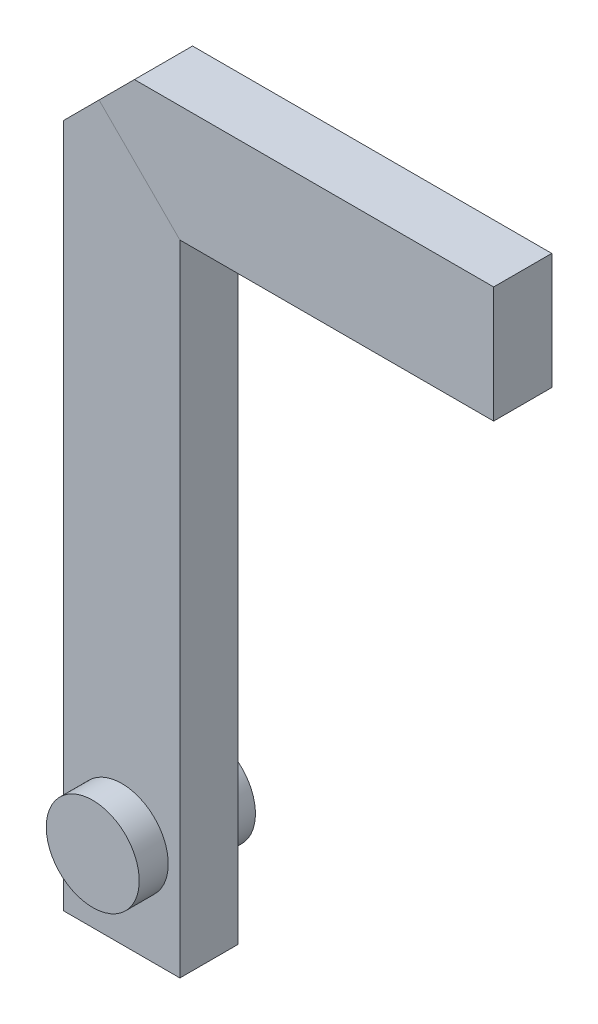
from build123d import *

# Parameters (mm, degrees)
CUT_EXTRUDE1_DEPTH       = 47.115167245
BOSS_EXTRUDE1_DEPTH      = 4.7625
BOSS_EXTRUDE1_DEPTH_BACK = 1.5875
BOSS_EXTRUDE1_START      = -3.175
SKETCH3_R                = 2.54


with BuildPart() as part:
    # Sweep1: sweep along a path in Sketch1
    with BuildLine(Plane.XY) as sweep1_path:
        Line((0, 0), (0, 38.1))
        Line((0, 38.1), (20.32, 38.1))
    # 3DSketch2 → Sweep1 (sweep)
    with BuildSketch(Plane(origin=(20.32, 34.925, -1.5875), x_dir=(0, 0.894427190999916, 0.4472135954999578), z_dir=(-1, 0, 0))):
        Polygon((0, 0), (5.679612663, 2.839806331), (7.099515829, 0), (1.419903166, -2.839806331), align=None)
    sweep(path=sweep1_path.line, transition=Transition.RIGHT)

    # Sketch2 → Cut-Extrude1 (cut, through all)
    with BuildSketch(Plane.XY.offset(1.5875)):
        Polygon((-3.175, 37.409050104), (-1.242025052, 39.342025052), (-3.175, 41.275), align=None)
        Polygon((-3.175, 41.275), (-1.242025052, 39.342025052), (0.690949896, 41.275), align=None)
    extrude(amount=-CUT_EXTRUDE1_DEPTH, mode=Mode.SUBTRACT)

    # Sketch3 → Boss-Extrude1 (add, two sides: drawn at the far end of the back side and taken through both)
    with BuildSketch(Plane.XY.offset(1.5875).offset(BOSS_EXTRUDE1_START - BOSS_EXTRUDE1_DEPTH_BACK)):
        with Locations(Location((0, 5.08, 0), (0, 0, 180))):
            Circle(SKETCH3_R)
    extrude(amount=BOSS_EXTRUDE1_DEPTH + BOSS_EXTRUDE1_DEPTH_BACK)


solid = part.part
